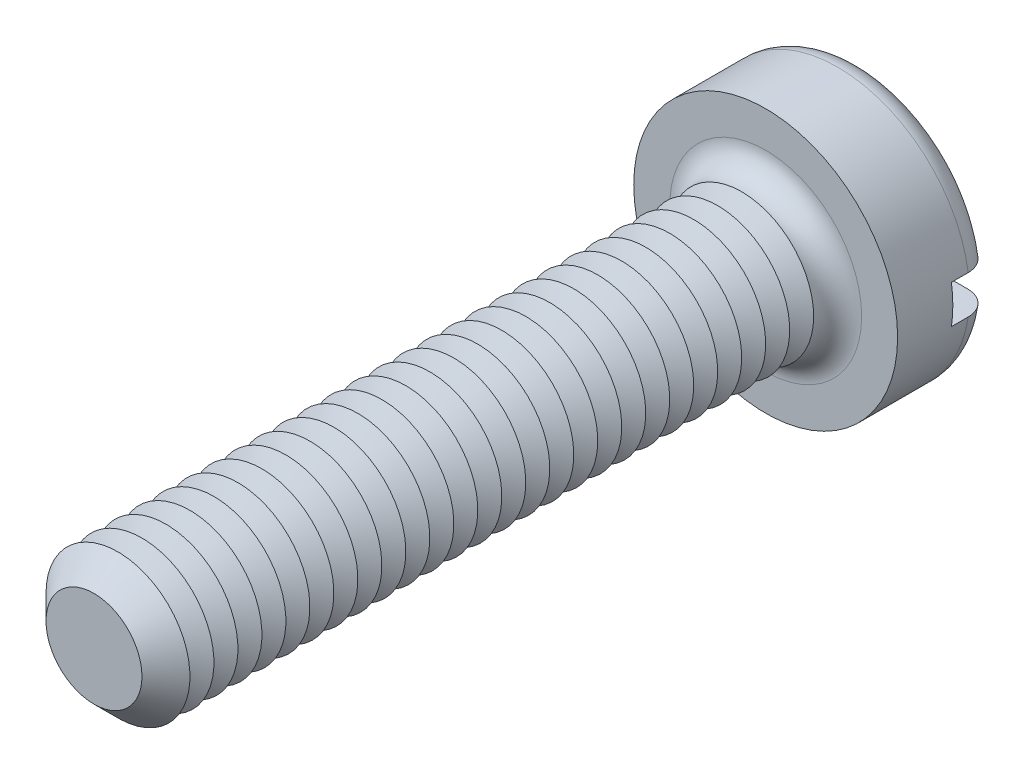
from build123d import *

# Parameters (mm, degrees)
SKETCH3_R           = 2.75
BOSS_EXTRUDE2_DEPTH = 2
SKETCH4_R           = 1.5
BOSS_EXTRUDE3_DEPTH = 14
FILLET1_R           = 0.5
CHAMFER1_SIZE       = 0.5
LPATTERN1_COUNT     = 26
LPATTERN1_PITCH     = 0.5
SKETCH8_W           = 5.5
SKETCH8_H           = 0.8
CUT_EXTRUDE1_DEPTH  = 0.85


with BuildPart() as part:
    # Sketch3 → Boss-Extrude2 (new body)
    with BuildSketch(Plane.XY):
        Circle(SKETCH3_R)
    extrude(amount=-BOSS_EXTRUDE2_DEPTH)

    # Sketch4 → Boss-Extrude3 (add)
    with BuildSketch(Plane.XY):
        Circle(SKETCH4_R)
    extrude(amount=BOSS_EXTRUDE3_DEPTH)

    # Fillet1
    fillet1_edges = [part.edges().sort_by_distance(p)[0] for p in [
        (-2.75, 0, -2),
        (-1.5, 0, 0),
    ]]
    fillet(fillet1_edges, radius=FILLET1_R)

    # Chamfer1
    chamfer1_edges = [part.edges().sort_by_distance(p)[0] for p in [
        (-1.5, 0, 14),
    ]]
    chamfer(chamfer1_edges, length=CHAMFER1_SIZE)

    # Sketch6 → Cut-Revolve1 (revolve, cut)
    with BuildSketch(Plane(origin=(0, 0, 0), x_dir=(0, 0, -1), z_dir=(1, 0, 0)), mode=Mode.PRIVATE) as cut_revolve1_sk:
        Polygon((-0.5, 1.5), (-0.75, 1.066987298), (-1, 1.5), align=None)
    cut_revolve1 = revolve(cut_revolve1_sk.sketch.rotate(Axis((0, 0, -1.694361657), (0, 0, 1)), 90), axis=Axis((0, 0, -1.694361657), (0, 0, 1)), mode=Mode.SUBTRACT)

    # LPattern1: Cut-Revolve1 ×26
    with Locations(*[(0, 0, i * LPATTERN1_PITCH) for i in range(1, LPATTERN1_COUNT)]):
        add(cut_revolve1, mode=Mode.SUBTRACT)

    # Sketch8 → Cut-Extrude1 (cut)
    with BuildSketch(Plane(origin=(0, 0, -2), x_dir=(-1, 0, 0), z_dir=(0, 0, -1))):
        Rectangle(SKETCH8_W, SKETCH8_H)
    extrude(amount=-CUT_EXTRUDE1_DEPTH, mode=Mode.SUBTRACT)


solid = part.part
